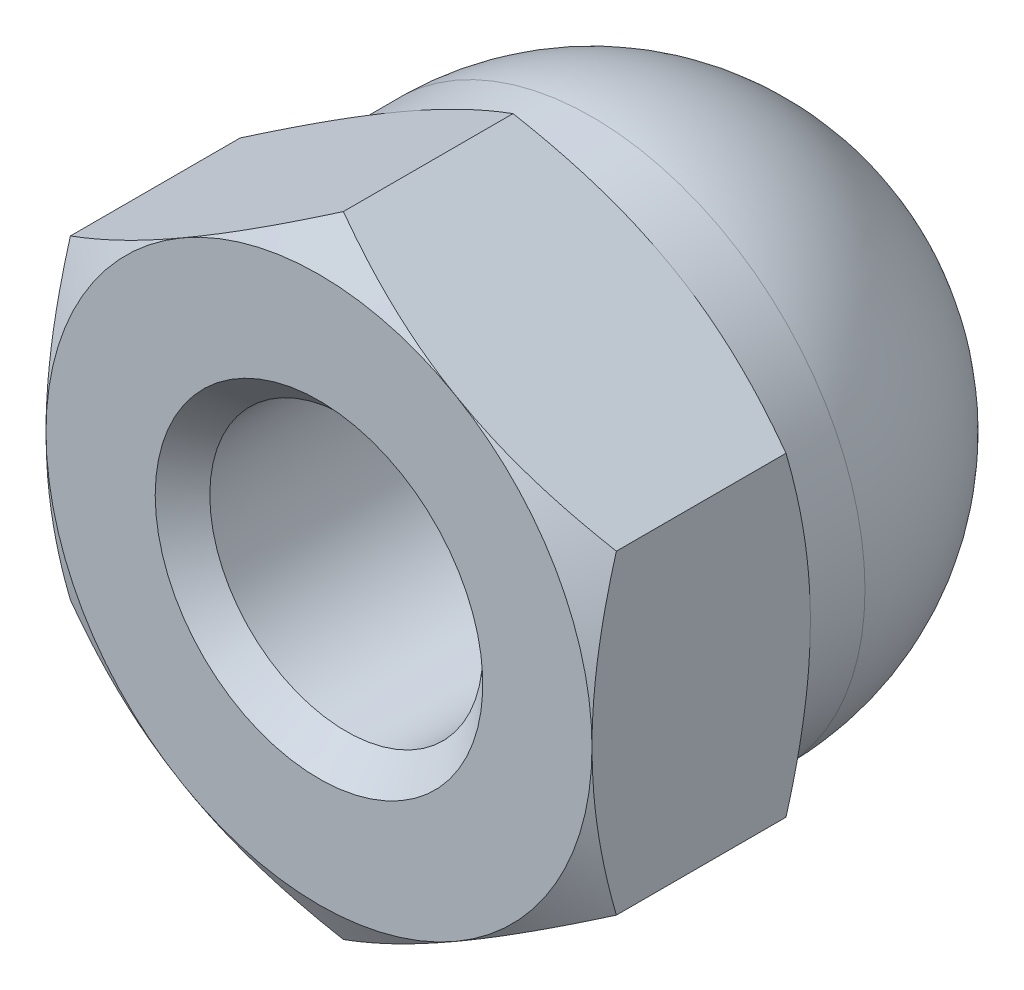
from build123d import *

# Parameters (mm, degrees)
BASE_EXTRUSION_DEPTH    = 4
ESQUISSE3_R             = 2.5
ENL_V_MAT_EXTRU_1_DEPTH = 4
CHANFREIN1_SIZE         = 0.5


with BuildPart() as part:
    # Esquisse1 → Base-Extrusion (new body)
    with BuildSketch(Plane.XY):
        Polygon((5, -2.886751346), (5, 2.886751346), (0, 5.773502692), (-5, 2.886751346), (-5, -2.886751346), (0, -5.773502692), align=None)
    extrude(amount=-BASE_EXTRUSION_DEPTH)

    # Esquisse2 → Enl_vement de mati_re-R_volution1 (revolve, cut)
    with BuildSketch(Plane(origin=(0, 0, 0), x_dir=(1, 0, 0), z_dir=(0, 1, 0))):
        Polygon((-5, 0), (-9.464101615, 0), (-9.464101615, 4), (-5, 4), (-8.464101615, 2), align=None)
    revolve(axis=Axis((0, 0, -4), (0, 0, 1)), mode=Mode.SUBTRACT)

    # Esquisse4 → Boss.-R_vol.1 (revolve)
    with BuildSketch(Plane(origin=(0, 0, 0), x_dir=(1, 0, 0), z_dir=(0, 1, 0)), mode=Mode.PRIVATE) as boss_r_vol_1_sk:
        with BuildLine():
            Line((-5, 5), (-5, 4))
            Line((-5, 4), (0, 4))
            Line((0, 4), (0, 10))
            ThreePointArc((0, 10), (-3.535533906, 8.535533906), (-5, 5))
        make_face()
    revolve(boss_r_vol_1_sk.sketch.rotate(Axis((0, 0, 0), (0, 0, -1)), 180), axis=Axis((0, 0, 0), (0, 0, -1)))

    # Esquisse3 → Enl_v. mat.-Extru.1 (cut)
    with BuildSketch(Plane.XY):
        Circle(ESQUISSE3_R)
    extrude(amount=-ENL_V_MAT_EXTRU_1_DEPTH, mode=Mode.SUBTRACT)

    # Chanfrein1
    chanfrein1_edges = [part.edges().sort_by_distance(p)[0] for p in [
        (-2.5, 0, 0),
    ]]
    chamfer(chanfrein1_edges, length=CHANFREIN1_SIZE)


solid = part.part
